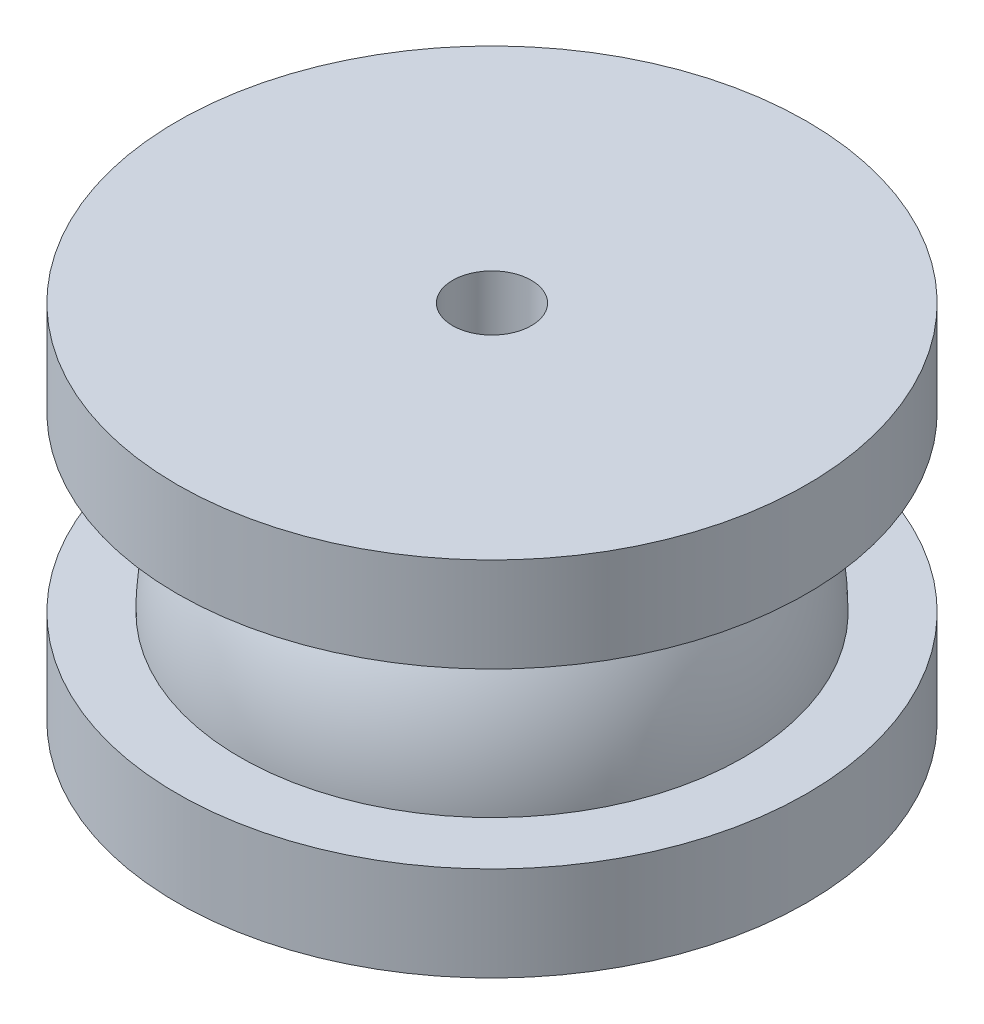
ISO-10303-21;
HEADER;
FILE_DESCRIPTION(('STEP AP214'),'2;1');
FILE_NAME('part.step','',(''),(''),'','','');
FILE_SCHEMA(('AUTOMOTIVE_DESIGN { 1 0 10303 214 1 1 1 1 }'));
ENDSEC;
DATA;
#1=APPLICATION_CONTEXT('core data for automotive mechanical design processes');
#2=APPLICATION_PROTOCOL_DEFINITION('international standard','automotive_design',2000,#1);
#3=PRODUCT_CONTEXT('',#1,'mechanical');
#4=PRODUCT('Part','Part','',(#3));
#5=PRODUCT_RELATED_PRODUCT_CATEGORY('part','',(#4));
#6=PRODUCT_DEFINITION_FORMATION('','',#4);
#7=PRODUCT_DEFINITION_CONTEXT('part definition',#1,'design');
#8=PRODUCT_DEFINITION('design','',#6,#7);
#9=PRODUCT_DEFINITION_SHAPE('','',#8);
#10=(LENGTH_UNIT() NAMED_UNIT(*) SI_UNIT(.MILLI.,.METRE.));
#11=(NAMED_UNIT(*) PLANE_ANGLE_UNIT() SI_UNIT($,.RADIAN.));
#12=(NAMED_UNIT(*) SI_UNIT($,.STERADIAN.) SOLID_ANGLE_UNIT());
#13=UNCERTAINTY_MEASURE_WITH_UNIT(LENGTH_MEASURE(1.E-05),#10,'distance_accuracy_value','');
#14=(GEOMETRIC_REPRESENTATION_CONTEXT(3) GLOBAL_UNCERTAINTY_ASSIGNED_CONTEXT((#13)) GLOBAL_UNIT_ASSIGNED_CONTEXT((#10,
#11,#12)) REPRESENTATION_CONTEXT('',''));
#15=CARTESIAN_POINT('',(0.,0.,0.));
#16=DIRECTION('',(0.,0.,1.));
#17=DIRECTION('',(1.,0.,0.));
#18=AXIS2_PLACEMENT_3D('',#15,#16,#17);
#19=CARTESIAN_POINT('',(0.,4.0000000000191,0.));
#20=DIRECTION('',(0.,-1.,0.));
#21=DIRECTION('',(0.,0.,-1.));
#22=AXIS2_PLACEMENT_3D('',#19,#20,#21);
#23=CONICAL_SURFACE('',#22,1.25000000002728,1.02974425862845);
#24=CARTESIAN_POINT('',(0.,4.7510757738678,0.));
#25=VERTEX_POINT('',#24);
#26=VERTEX_LOOP('',#25);
#27=FACE_BOUND('',#26,.T.);
#28=CARTESIAN_POINT('',(0.,4.,0.));
#29=DIRECTION('',(0.,-1.,0.));
#30=DIRECTION('',(0.,0.,-1.));
#31=AXIS2_PLACEMENT_3D('',#28,#29,#30);
#32=CIRCLE('',#31,1.24999999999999);
#33=CARTESIAN_POINT('',(0.,4.,-1.24999999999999));
#34=VERTEX_POINT('',#33);
#35=EDGE_CURVE('E66',#34,#34,#32,.T.);
#36=ORIENTED_EDGE('',*,*,#35,.T.);
#37=EDGE_LOOP('',(#36));
#38=FACE_BOUND('',#37,.T.);
#39=ADVANCED_FACE('F17',(#27,#38),#23,.F.);
#40=CARTESIAN_POINT('',(0.,0.,0.));
#41=DIRECTION('',(0.,-1.,0.));
#42=DIRECTION('',(0.,0.,-1.));
#43=AXIS2_PLACEMENT_3D('',#40,#41,#42);
#44=CYLINDRICAL_SURFACE('',#43,1.24999999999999);
#45=CARTESIAN_POINT('',(0.,0.,0.));
#46=DIRECTION('',(0.,-1.,0.));
#47=DIRECTION('',(0.,0.,-1.));
#48=AXIS2_PLACEMENT_3D('',#45,#46,#47);
#49=CIRCLE('',#48,1.24999999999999);
#50=CARTESIAN_POINT('',(0.,0.,-1.24999999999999));
#51=VERTEX_POINT('',#50);
#52=EDGE_CURVE('E20',#51,#51,#49,.F.);
#53=ORIENTED_EDGE('',*,*,#52,.F.);
#54=EDGE_LOOP('',(#53));
#55=FACE_BOUND('',#54,.T.);
#56=ORIENTED_EDGE('',*,*,#35,.F.);
#57=EDGE_LOOP('',(#56));
#58=FACE_BOUND('',#57,.T.);
#59=ADVANCED_FACE('F173',(#55,#58),#44,.F.);
#60=CARTESIAN_POINT('',(0.,0.,0.));
#61=DIRECTION('',(0.,-1.,0.));
#62=DIRECTION('',(1.,0.,0.));
#63=AXIS2_PLACEMENT_3D('',#60,#61,#62);
#64=PLANE('',#63);
#65=CARTESIAN_POINT('',(0.,0.,0.));
#66=DIRECTION('',(0.,-1.,0.));
#67=DIRECTION('',(1.,0.,0.));
#68=AXIS2_PLACEMENT_3D('',#65,#66,#67);
#69=CIRCLE('',#68,10.);
#70=CARTESIAN_POINT('',(10.,0.,0.));
#71=VERTEX_POINT('',#70);
#72=EDGE_CURVE('E61',#71,#71,#69,.F.);
#73=ORIENTED_EDGE('',*,*,#72,.F.);
#74=EDGE_LOOP('',(#73));
#75=FACE_BOUND('',#74,.T.);
#76=ORIENTED_EDGE('',*,*,#52,.T.);
#77=EDGE_LOOP('',(#76));
#78=FACE_BOUND('',#77,.T.);
#79=ADVANCED_FACE('F163',(#75,#78),#64,.T.);
#80=CARTESIAN_POINT('',(0.,0.,0.));
#81=DIRECTION('',(0.,-1.,0.));
#82=DIRECTION('',(1.,0.,0.));
#83=AXIS2_PLACEMENT_3D('',#80,#81,#82);
#84=CYLINDRICAL_SURFACE('',#83,10.);
#85=CARTESIAN_POINT('',(0.,3.,0.));
#86=DIRECTION('',(0.,-1.,0.));
#87=DIRECTION('',(1.,0.,0.));
#88=AXIS2_PLACEMENT_3D('',#85,#86,#87);
#89=CIRCLE('',#88,10.);
#90=CARTESIAN_POINT('',(10.,3.,0.));
#91=VERTEX_POINT('',#90);
#92=EDGE_CURVE('E46',#91,#91,#89,.F.);
#93=ORIENTED_EDGE('',*,*,#92,.F.);
#94=EDGE_LOOP('',(#93));
#95=FACE_BOUND('',#94,.T.);
#96=ORIENTED_EDGE('',*,*,#72,.T.);
#97=EDGE_LOOP('',(#96));
#98=FACE_BOUND('',#97,.T.);
#99=ADVANCED_FACE('F153',(#95,#98),#84,.T.);
#100=CARTESIAN_POINT('',(10.,3.,0.));
#101=DIRECTION('',(0.,1.,0.));
#102=DIRECTION('',(-1.,0.,0.));
#103=AXIS2_PLACEMENT_3D('',#100,#101,#102);
#104=PLANE('',#103);
#105=ORIENTED_EDGE('',*,*,#92,.T.);
#106=EDGE_LOOP('',(#105));
#107=FACE_BOUND('',#106,.T.);
#108=CARTESIAN_POINT('',(0.,3.,0.));
#109=DIRECTION('',(0.,-1.,0.));
#110=DIRECTION('',(1.,0.,0.));
#111=AXIS2_PLACEMENT_3D('',#108,#109,#110);
#112=CIRCLE('',#111,8.);
#113=CARTESIAN_POINT('',(-8.,3.,0.));
#114=VERTEX_POINT('',#113);
#115=CARTESIAN_POINT('',(8.,3.,0.));
#116=VERTEX_POINT('',#115);
#117=EDGE_CURVE('E44',#114,#116,#112,.F.);
#118=ORIENTED_EDGE('',*,*,#117,.F.);
#119=CARTESIAN_POINT('',(0.,3.,0.));
#120=DIRECTION('',(0.,-1.,0.));
#121=DIRECTION('',(1.,0.,0.));
#122=AXIS2_PLACEMENT_3D('',#119,#120,#121);
#123=CIRCLE('',#122,8.);
#124=EDGE_CURVE('E40',#116,#114,#123,.F.);
#125=ORIENTED_EDGE('',*,*,#124,.F.);
#126=EDGE_LOOP('',(#118,#125));
#127=FACE_BOUND('',#126,.T.);
#128=ADVANCED_FACE('F48',(#107,#127),#104,.T.);
#129=CARTESIAN_POINT('',(0.,3.,0.));
#130=DIRECTION('',(1.,0.,0.));
#131=DIRECTION('',(0.,1.,0.));
#132=AXIS2_PLACEMENT_3D('',#129,#130,#131);
#133=SPHERICAL_SURFACE('',#132,8.);
#134=ORIENTED_EDGE('',*,*,#124,.T.);
#135=ORIENTED_EDGE('',*,*,#117,.T.);
#136=EDGE_LOOP('',(#134,#135));
#137=FACE_BOUND('',#136,.T.);
#138=CARTESIAN_POINT('',(5.80947501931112,8.5,0.));
#139=CARTESIAN_POINT('',(5.80947411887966,8.5,0.163111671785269));
#140=CARTESIAN_POINT('',(5.80259978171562,8.5,0.326252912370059));
#141=CARTESIAN_POINT('',(5.7751449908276,8.5,0.651410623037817));
#142=CARTESIAN_POINT('',(5.75456049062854,8.5,0.81342674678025));
#143=CARTESIAN_POINT('',(5.6997848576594,8.5,1.13541206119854));
#144=CARTESIAN_POINT('',(5.66557212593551,8.5,1.29537758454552));
#145=CARTESIAN_POINT('',(5.58375031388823,8.5,1.61198284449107));
#146=CARTESIAN_POINT('',(5.53613036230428,8.5,1.76861977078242));
#147=CARTESIAN_POINT('',(5.42793865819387,8.5,2.07705189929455));
#148=CARTESIAN_POINT('',(5.36738934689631,8.5,2.22885497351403));
#149=CARTESIAN_POINT('',(5.23369042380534,8.5,2.52688973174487));
#150=CARTESIAN_POINT('',(5.16053511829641,8.5,2.67311886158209));
#151=CARTESIAN_POINT('',(5.00216044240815,8.5,2.95889844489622));
#152=CARTESIAN_POINT('',(4.91694061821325,8.5,3.0984486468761));
#153=CARTESIAN_POINT('',(4.73508630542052,8.5,3.369810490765));
#154=CARTESIAN_POINT('',(4.63845699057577,8.5,3.50162559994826));
#155=CARTESIAN_POINT('',(4.4343735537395,8.5,3.75673137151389));
#156=CARTESIAN_POINT('',(4.32691247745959,8.5,3.8800164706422));
#157=CARTESIAN_POINT('',(4.1020908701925,8.5,4.11697687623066));
#158=CARTESIAN_POINT('',(3.98473998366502,8.5,4.23066133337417));
#159=CARTESIAN_POINT('',(3.740827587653,8.5,4.44779507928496));
#160=CARTESIAN_POINT('',(3.61426192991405,8.5,4.55123970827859));
#161=CARTESIAN_POINT('',(3.35283637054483,8.5,4.74712258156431));
#162=CARTESIAN_POINT('',(3.2179745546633,8.5,4.83955827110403));
#163=CARTESIAN_POINT('',(2.94098909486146,8.5,5.01270881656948));
#164=CARTESIAN_POINT('',(2.79886791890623,8.5,5.09342762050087));
#165=CARTESIAN_POINT('',(2.50827823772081,8.5,5.2426354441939));
#166=CARTESIAN_POINT('',(2.35980741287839,8.5,5.31111994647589));
#167=CARTESIAN_POINT('',(2.0576811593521,8.5,5.43531177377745));
#168=CARTESIAN_POINT('',(1.9040277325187,8.5,5.49102396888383));
#169=CARTESIAN_POINT('',(1.59251604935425,8.5,5.58932718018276));
#170=CARTESIAN_POINT('',(1.43465624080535,8.5,5.6319132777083));
#171=CARTESIAN_POINT('',(1.11597493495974,8.5,5.7036184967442));
#172=CARTESIAN_POINT('',(0.955154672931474,8.5,5.73274310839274));
#173=CARTESIAN_POINT('',(0.631559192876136,8.5,5.77735415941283));
#174=CARTESIAN_POINT('',(0.46878312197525,8.5,5.79283441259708));
#175=CARTESIAN_POINT('',(0.142505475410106,8.5,5.81002412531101));
#176=CARTESIAN_POINT('',(-0.020996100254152,8.50000000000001,5.81173358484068));
#177=CARTESIAN_POINT('',(-0.347487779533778,8.49999999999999,5.8013719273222));
#178=CARTESIAN_POINT('',(-0.510478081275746,8.49999999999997,5.78930705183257));
#179=CARTESIAN_POINT('',(-0.834929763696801,8.49999999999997,5.75148485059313));
#180=CARTESIAN_POINT('',(-0.996390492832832,8.49999999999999,5.72572193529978));
#181=CARTESIAN_POINT('',(-1.31650707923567,8.50000000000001,5.6606956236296));
#182=CARTESIAN_POINT('',(-1.47516396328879,8.5,5.62143728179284));
#183=CARTESIAN_POINT('',(-1.78866737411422,8.5,5.52967947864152));
#184=CARTESIAN_POINT('',(-1.94351242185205,8.50000000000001,5.47717496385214));
#185=CARTESIAN_POINT('',(-2.24817173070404,8.49999999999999,5.35932742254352));
#186=CARTESIAN_POINT('',(-2.39798782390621,8.49999999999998,5.29398913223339));
#187=CARTESIAN_POINT('',(-2.69163405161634,8.49999999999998,5.15090192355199));
#188=CARTESIAN_POINT('',(-2.83546214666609,8.49999999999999,5.07314881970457));
#189=CARTESIAN_POINT('',(-3.11602325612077,8.50000000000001,4.90582014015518));
#190=CARTESIAN_POINT('',(-3.25275790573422,8.5,4.81624730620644));
#191=CARTESIAN_POINT('',(-3.51813578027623,8.5,4.62594516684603));
#192=CARTESIAN_POINT('',(-3.64678264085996,8.50000000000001,4.52522093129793));
#193=CARTESIAN_POINT('',(-3.89525873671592,8.49999999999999,4.31319588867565));
#194=CARTESIAN_POINT('',(-4.01507934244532,8.49999999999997,4.20188496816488));
#195=CARTESIAN_POINT('',(-4.24483873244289,8.49999999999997,3.96963590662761));
#196=CARTESIAN_POINT('',(-4.35478384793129,8.49999999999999,3.84870402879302));
#197=CARTESIAN_POINT('',(-4.56414531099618,8.50000000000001,3.59795311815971));
#198=CARTESIAN_POINT('',(-4.66355687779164,8.5,3.46813009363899));
#199=CARTESIAN_POINT('',(-4.85108365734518,8.5,3.20057408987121));
#200=CARTESIAN_POINT('',(-4.93919929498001,8.5,3.06284140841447));
#201=CARTESIAN_POINT('',(-5.10347466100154,8.5,2.78050522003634));
#202=CARTESIAN_POINT('',(-5.17963978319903,8.5,2.63590485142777));
#203=CARTESIAN_POINT('',(-5.31964165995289,8.5,2.34054863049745));
#204=CARTESIAN_POINT('',(-5.38345692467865,8.5,2.18978259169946));
#205=CARTESIAN_POINT('',(-5.4980936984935,8.5,1.88352761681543));
#206=CARTESIAN_POINT('',(-5.54892572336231,8.5,1.7280426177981));
#207=CARTESIAN_POINT('',(-5.63723136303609,8.5,1.41359544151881));
#208=CARTESIAN_POINT('',(-5.67472607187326,8.5,1.25463918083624));
#209=CARTESIAN_POINT('',(-5.73619546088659,8.5,0.934166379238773));
#210=CARTESIAN_POINT('',(-5.76017412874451,8.5,0.772650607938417));
#211=CARTESIAN_POINT('',(-5.78802600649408,8.5,0.509070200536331));
#212=CARTESIAN_POINT('',(-5.79606687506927,8.5,0.407427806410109));
#213=CARTESIAN_POINT('',(-5.80679166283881,8.5,0.203860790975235));
#214=CARTESIAN_POINT('',(-5.80947558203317,8.5,0.101936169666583));
#215=CARTESIAN_POINT('',(-5.80947411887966,8.5,-0.163111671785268));
#216=CARTESIAN_POINT('',(-5.80259978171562,8.5,-0.326252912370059));
#217=CARTESIAN_POINT('',(-5.77514499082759,8.5,-0.651410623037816));
#218=CARTESIAN_POINT('',(-5.75456049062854,8.5,-0.813426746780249));
#219=CARTESIAN_POINT('',(-5.6997848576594,8.5,-1.13541206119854));
#220=CARTESIAN_POINT('',(-5.6655721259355,8.5,-1.29537758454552));
#221=CARTESIAN_POINT('',(-5.58375031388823,8.5,-1.61198284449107));
#222=CARTESIAN_POINT('',(-5.53613036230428,8.5,-1.76861977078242));
#223=CARTESIAN_POINT('',(-5.42793865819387,8.5,-2.07705189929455));
#224=CARTESIAN_POINT('',(-5.3673893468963,8.5,-2.22885497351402));
#225=CARTESIAN_POINT('',(-5.23369042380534,8.5,-2.52688973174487));
#226=CARTESIAN_POINT('',(-5.16053511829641,8.5,-2.67311886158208));
#227=CARTESIAN_POINT('',(-5.00216044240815,8.5,-2.95889844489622));
#228=CARTESIAN_POINT('',(-4.91694061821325,8.5,-3.0984486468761));
#229=CARTESIAN_POINT('',(-4.73508630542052,8.5,-3.369810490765));
#230=CARTESIAN_POINT('',(-4.63845699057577,8.5,-3.50162559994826));
#231=CARTESIAN_POINT('',(-4.43437355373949,8.5,-3.75673137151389));
#232=CARTESIAN_POINT('',(-4.32691247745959,8.5,-3.8800164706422));
#233=CARTESIAN_POINT('',(-4.1020908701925,8.5,-4.11697687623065));
#234=CARTESIAN_POINT('',(-3.98473998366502,8.5,-4.23066133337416));
#235=CARTESIAN_POINT('',(-3.740827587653,8.5,-4.44779507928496));
#236=CARTESIAN_POINT('',(-3.61426192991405,8.5,-4.55123970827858));
#237=CARTESIAN_POINT('',(-3.35283637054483,8.5,-4.74712258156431));
#238=CARTESIAN_POINT('',(-3.2179745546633,8.5,-4.83955827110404));
#239=CARTESIAN_POINT('',(-2.94098909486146,8.5,-5.01270881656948));
#240=CARTESIAN_POINT('',(-2.79886791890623,8.5,-5.09342762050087));
#241=CARTESIAN_POINT('',(-2.50827823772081,8.5,-5.2426354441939));
#242=CARTESIAN_POINT('',(-2.35980741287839,8.5,-5.31111994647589));
#243=CARTESIAN_POINT('',(-2.0576811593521,8.5,-5.43531177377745));
#244=CARTESIAN_POINT('',(-1.9040277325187,8.5,-5.49102396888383));
#245=CARTESIAN_POINT('',(-1.59251604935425,8.5,-5.58932718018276));
#246=CARTESIAN_POINT('',(-1.43465624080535,8.5,-5.63191327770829));
#247=CARTESIAN_POINT('',(-1.11597493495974,8.5,-5.7036184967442));
#248=CARTESIAN_POINT('',(-0.955154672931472,8.5,-5.73274310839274));
#249=CARTESIAN_POINT('',(-0.631559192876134,8.5,-5.77735415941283));
#250=CARTESIAN_POINT('',(-0.468783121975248,8.5,-5.79283441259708));
#251=CARTESIAN_POINT('',(-0.142505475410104,8.5,-5.81002412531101));
#252=CARTESIAN_POINT('',(0.0209961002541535,8.50000000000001,-5.81173358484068));
#253=CARTESIAN_POINT('',(0.34748777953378,8.49999999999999,-5.8013719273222));
#254=CARTESIAN_POINT('',(0.510478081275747,8.49999999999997,-5.78930705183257));
#255=CARTESIAN_POINT('',(0.834929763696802,8.49999999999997,-5.75148485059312));
#256=CARTESIAN_POINT('',(0.996390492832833,8.49999999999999,-5.72572193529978));
#257=CARTESIAN_POINT('',(1.31650707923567,8.50000000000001,-5.66069562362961));
#258=CARTESIAN_POINT('',(1.47516396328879,8.5,-5.62143728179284));
#259=CARTESIAN_POINT('',(1.78866737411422,8.5,-5.52967947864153));
#260=CARTESIAN_POINT('',(1.94351242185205,8.50000000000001,-5.47717496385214));
#261=CARTESIAN_POINT('',(2.24817173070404,8.49999999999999,-5.35932742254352));
#262=CARTESIAN_POINT('',(2.39798782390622,8.49999999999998,-5.29398913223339));
#263=CARTESIAN_POINT('',(2.69163405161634,8.49999999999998,-5.15090192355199));
#264=CARTESIAN_POINT('',(2.83546214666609,8.49999999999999,-5.07314881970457));
#265=CARTESIAN_POINT('',(3.11602325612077,8.50000000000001,-4.90582014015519));
#266=CARTESIAN_POINT('',(3.25275790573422,8.5,-4.81624730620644));
#267=CARTESIAN_POINT('',(3.51813578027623,8.5,-4.62594516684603));
#268=CARTESIAN_POINT('',(3.64678264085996,8.50000000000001,-4.52522093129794));
#269=CARTESIAN_POINT('',(3.89525873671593,8.49999999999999,-4.31319588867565));
#270=CARTESIAN_POINT('',(4.01507934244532,8.49999999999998,-4.20188496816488));
#271=CARTESIAN_POINT('',(4.24483873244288,8.49999999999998,-3.96963590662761));
#272=CARTESIAN_POINT('',(4.35478384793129,8.49999999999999,-3.84870402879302));
#273=CARTESIAN_POINT('',(4.56414531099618,8.50000000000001,-3.59795311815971));
#274=CARTESIAN_POINT('',(4.66355687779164,8.5,-3.46813009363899));
#275=CARTESIAN_POINT('',(4.85108365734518,8.5,-3.20057408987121));
#276=CARTESIAN_POINT('',(4.93919929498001,8.5,-3.06284140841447));
#277=CARTESIAN_POINT('',(5.10347466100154,8.5,-2.78050522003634));
#278=CARTESIAN_POINT('',(5.17963978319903,8.5,-2.63590485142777));
#279=CARTESIAN_POINT('',(5.31964165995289,8.5,-2.34054863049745));
#280=CARTESIAN_POINT('',(5.38345692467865,8.5,-2.18978259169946));
#281=CARTESIAN_POINT('',(5.4980936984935,8.5,-1.88352761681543));
#282=CARTESIAN_POINT('',(5.54892572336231,8.5,-1.7280426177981));
#283=CARTESIAN_POINT('',(5.63723136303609,8.5,-1.41359544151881));
#284=CARTESIAN_POINT('',(5.67472607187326,8.5,-1.25463918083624));
#285=CARTESIAN_POINT('',(5.7361954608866,8.5,-0.934166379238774));
#286=CARTESIAN_POINT('',(5.76017412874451,8.5,-0.772650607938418));
#287=CARTESIAN_POINT('',(5.78802600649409,8.5,-0.509070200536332));
#288=CARTESIAN_POINT('',(5.79606687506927,8.5,-0.407427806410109));
#289=CARTESIAN_POINT('',(5.80679166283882,8.5,-0.203860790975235));
#290=CARTESIAN_POINT('',(5.80947558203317,8.5,-0.101936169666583));
#291=CARTESIAN_POINT('',(5.80947501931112,8.5,0.));
#292=B_SPLINE_CURVE_WITH_KNOTS('',3,(#138,#139,#140,#141,#142,#143,#144,#145,#146,#147,#148,
#149,#150,#151,#152,#153,#154,#155,#156,#157,#158,#159,#160,#161,#162,#163,#164,#165,#166,#167,
#168,#169,#170,#171,#172,#173,#174,#175,#176,#177,#178,#179,#180,#181,#182,#183,#184,#185,#186,
#187,#188,#189,#190,#191,#192,#193,#194,#195,#196,#197,#198,#199,#200,#201,#202,#203,#204,#205,
#206,#207,#208,#209,#210,#211,#212,#213,#214,#215,#216,#217,#218,#219,#220,#221,#222,#223,#224,
#225,#226,#227,#228,#229,#230,#231,#232,#233,#234,#235,#236,#237,#238,#239,#240,#241,#242,#243,
#244,#245,#246,#247,#248,#249,#250,#251,#252,#253,#254,#255,#256,#257,#258,#259,#260,#261,#262,
#263,#264,#265,#266,#267,#268,#269,#270,#271,#272,#273,#274,#275,#276,#277,#278,#279,#280,#281,
#282,#283,#284,#285,#286,#287,#288,#289,#290,#291),.UNSPECIFIED.,.T.,.F.,(4,2,2,2,2,2,2,2,2,2,2,
2,2,2,2,2,2,2,2,2,2,2,2,2,2,2,2,2,2,2,2,2,2,2,2,2,2,2,2,2,2,2,2,2,2,2,2,2,2,2,2,2,2,2,2,2,2,2,2,
2,2,2,2,2,2,2,2,2,2,2,2,2,2,2,2,2,4),(0.,0.489241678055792,0.978627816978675,1.46879267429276,
1.95935613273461,2.44907495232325,2.93901554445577,3.42897457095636,3.91871226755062,
4.40876641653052,4.89834807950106,5.38815151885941,5.8780684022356,6.36781982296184,
6.85775171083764,7.34749647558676,7.83742453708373,8.32715260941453,8.8171026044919,
9.30705259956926,9.79678067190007,10.286708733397,10.7764534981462,11.266385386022,
11.7561368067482,12.2460536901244,12.7358571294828,13.2254387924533,13.7154929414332,
14.2052306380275,14.695189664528,15.1851302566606,15.6748490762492,16.1654125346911,
16.6555773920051,17.144963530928,17.6342052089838,17.9399553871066,18.2457055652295,
18.7349472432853,19.2243333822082,19.7144982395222,20.2050616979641,20.6947805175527,
21.1847211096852,21.6746801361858,22.1644178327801,22.65447198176,23.1440536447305,
23.6338570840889,24.1237739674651,24.6135253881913,25.1034572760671,25.5932020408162,
26.0831301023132,26.572858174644,27.0628081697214,27.5527581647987,28.0424862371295,
28.5324142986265,29.0221590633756,29.5120909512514,30.0018423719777,30.4917592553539,
30.9815626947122,31.4711443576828,31.9611985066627,32.4509362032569,32.9408952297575,
33.43083582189,33.9205546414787,34.4111180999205,34.9012829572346,35.3906690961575,
35.8799107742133,36.1856609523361,36.491411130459),.UNSPECIFIED.);
#293=CARTESIAN_POINT('',(5.80947501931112,8.5,0.));
#294=VERTEX_POINT('',#293);
#295=EDGE_CURVE('E49',#294,#294,#292,.T.);
#296=ORIENTED_EDGE('',*,*,#295,.T.);
#297=EDGE_LOOP('',(#296));
#298=FACE_BOUND('',#297,.T.);
#299=ADVANCED_FACE('F42',(#137,#298),#133,.T.);
#300=CARTESIAN_POINT('',(0.,6.99999999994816,0.));
#301=DIRECTION('',(0.,1.,0.));
#302=DIRECTION('',(-1.,0.,0.));
#303=AXIS2_PLACEMENT_3D('',#300,#301,#302);
#304=CONICAL_SURFACE('',#303,1.24999999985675,1.02974425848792);
#305=CARTESIAN_POINT('',(0.,6.2489242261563,0.));
#306=VERTEX_POINT('',#305);
#307=VERTEX_LOOP('',#306);
#308=FACE_BOUND('',#307,.T.);
#309=CARTESIAN_POINT('',(0.,7.,0.));
#310=DIRECTION('',(0.,1.,0.));
#311=DIRECTION('',(0.,0.,1.));
#312=AXIS2_PLACEMENT_3D('',#309,#310,#311);
#313=CIRCLE('',#312,1.24999999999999);
#314=CARTESIAN_POINT('',(0.,7.,1.24999999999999));
#315=VERTEX_POINT('',#314);
#316=EDGE_CURVE('E52',#315,#315,#313,.T.);
#317=ORIENTED_EDGE('',*,*,#316,.T.);
#318=EDGE_LOOP('',(#317));
#319=FACE_BOUND('',#318,.T.);
#320=ADVANCED_FACE('F85',(#308,#319),#304,.F.);
#321=CARTESIAN_POINT('',(0.,8.5,0.));
#322=DIRECTION('',(0.,1.,0.));
#323=DIRECTION('',(0.,0.,1.));
#324=AXIS2_PLACEMENT_3D('',#321,#322,#323);
#325=PLANE('',#324);
#326=CARTESIAN_POINT('',(0.,8.5,0.));
#327=DIRECTION('',(0.,-1.,0.));
#328=DIRECTION('',(0.,0.,-1.));
#329=AXIS2_PLACEMENT_3D('',#326,#327,#328);
#330=CIRCLE('',#329,10.);
#331=CARTESIAN_POINT('',(0.,8.5,-10.));
#332=VERTEX_POINT('',#331);
#333=EDGE_CURVE('E78',#332,#332,#330,.F.);
#334=ORIENTED_EDGE('',*,*,#333,.F.);
#335=EDGE_LOOP('',(#334));
#336=FACE_BOUND('',#335,.T.);
#337=ORIENTED_EDGE('',*,*,#295,.F.);
#338=EDGE_LOOP('',(#337));
#339=FACE_BOUND('',#338,.T.);
#340=ADVANCED_FACE('F90',(#336,#339),#325,.F.);
#341=CARTESIAN_POINT('',(0.,11.5,0.));
#342=DIRECTION('',(0.,1.,0.));
#343=DIRECTION('',(0.,0.,1.));
#344=AXIS2_PLACEMENT_3D('',#341,#342,#343);
#345=CYLINDRICAL_SURFACE('',#344,1.24999999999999);
#346=CARTESIAN_POINT('',(0.,11.5,0.));
#347=DIRECTION('',(0.,1.,0.));
#348=DIRECTION('',(0.,0.,1.));
#349=AXIS2_PLACEMENT_3D('',#346,#347,#348);
#350=CIRCLE('',#349,1.24999999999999);
#351=CARTESIAN_POINT('',(0.,11.5,1.24999999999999));
#352=VERTEX_POINT('',#351);
#353=EDGE_CURVE('E26',#352,#352,#350,.F.);
#354=ORIENTED_EDGE('',*,*,#353,.F.);
#355=EDGE_LOOP('',(#354));
#356=FACE_BOUND('',#355,.T.);
#357=ORIENTED_EDGE('',*,*,#316,.F.);
#358=EDGE_LOOP('',(#357));
#359=FACE_BOUND('',#358,.T.);
#360=ADVANCED_FACE('F87',(#356,#359),#345,.F.);
#361=CARTESIAN_POINT('',(0.,11.5,0.));
#362=DIRECTION('',(0.,-1.,0.));
#363=DIRECTION('',(0.,0.,-1.));
#364=AXIS2_PLACEMENT_3D('',#361,#362,#363);
#365=CYLINDRICAL_SURFACE('',#364,10.);
#366=ORIENTED_EDGE('',*,*,#333,.T.);
#367=EDGE_LOOP('',(#366));
#368=FACE_BOUND('',#367,.T.);
#369=CARTESIAN_POINT('',(0.,11.5,0.));
#370=DIRECTION('',(0.,-1.,0.));
#371=DIRECTION('',(0.,0.,-1.));
#372=AXIS2_PLACEMENT_3D('',#369,#370,#371);
#373=CIRCLE('',#372,10.);
#374=CARTESIAN_POINT('',(0.,11.5,-10.));
#375=VERTEX_POINT('',#374);
#376=EDGE_CURVE('E11',#375,#375,#373,.F.);
#377=ORIENTED_EDGE('',*,*,#376,.F.);
#378=EDGE_LOOP('',(#377));
#379=FACE_BOUND('',#378,.T.);
#380=ADVANCED_FACE('F89',(#368,#379),#365,.T.);
#381=CARTESIAN_POINT('',(0.,11.5,0.));
#382=DIRECTION('',(0.,1.,0.));
#383=DIRECTION('',(0.,0.,1.));
#384=AXIS2_PLACEMENT_3D('',#381,#382,#383);
#385=PLANE('',#384);
#386=ORIENTED_EDGE('',*,*,#376,.T.);
#387=EDGE_LOOP('',(#386));
#388=FACE_BOUND('',#387,.T.);
#389=ORIENTED_EDGE('',*,*,#353,.T.);
#390=EDGE_LOOP('',(#389));
#391=FACE_BOUND('',#390,.T.);
#392=ADVANCED_FACE('F98',(#388,#391),#385,.T.);
#393=CLOSED_SHELL('',(#39,#59,#79,#99,#128,#299,#320,#340,#360,#380,#392));
#394=MANIFOLD_SOLID_BREP('B1',#393);
#395=ADVANCED_BREP_SHAPE_REPRESENTATION('',(#18,#394),#14);
#396=SHAPE_DEFINITION_REPRESENTATION(#9,#395);
ENDSEC;
END-ISO-10303-21;
